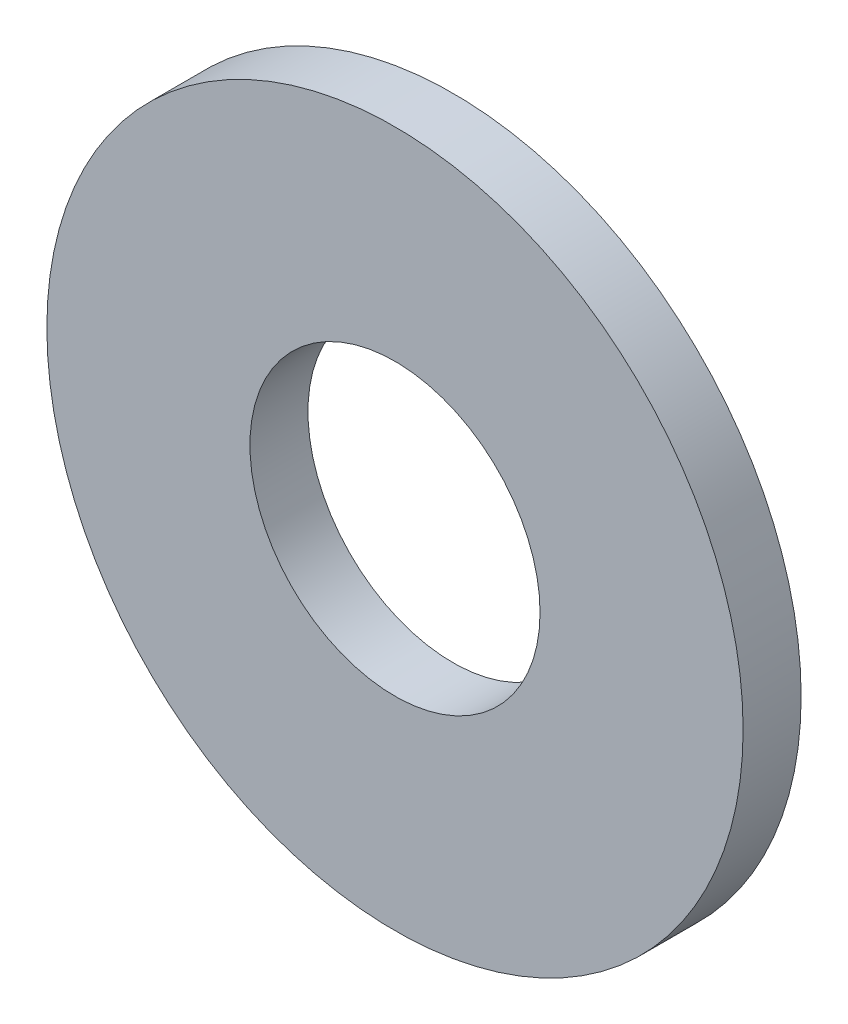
from build123d import *

# Parameters (mm, degrees)
SKETCH1_R    = 9.525
SKETCH1_R_2  = 3.96875
WASHER_DEPTH = 1.5875


with BuildPart() as part:
    # Sketch1 → Washer (new body)
    with BuildSketch(Plane.XY):
        Circle(SKETCH1_R)
        Circle(SKETCH1_R_2, mode=Mode.SUBTRACT)
    extrude(amount=WASHER_DEPTH)


solid = part.part
